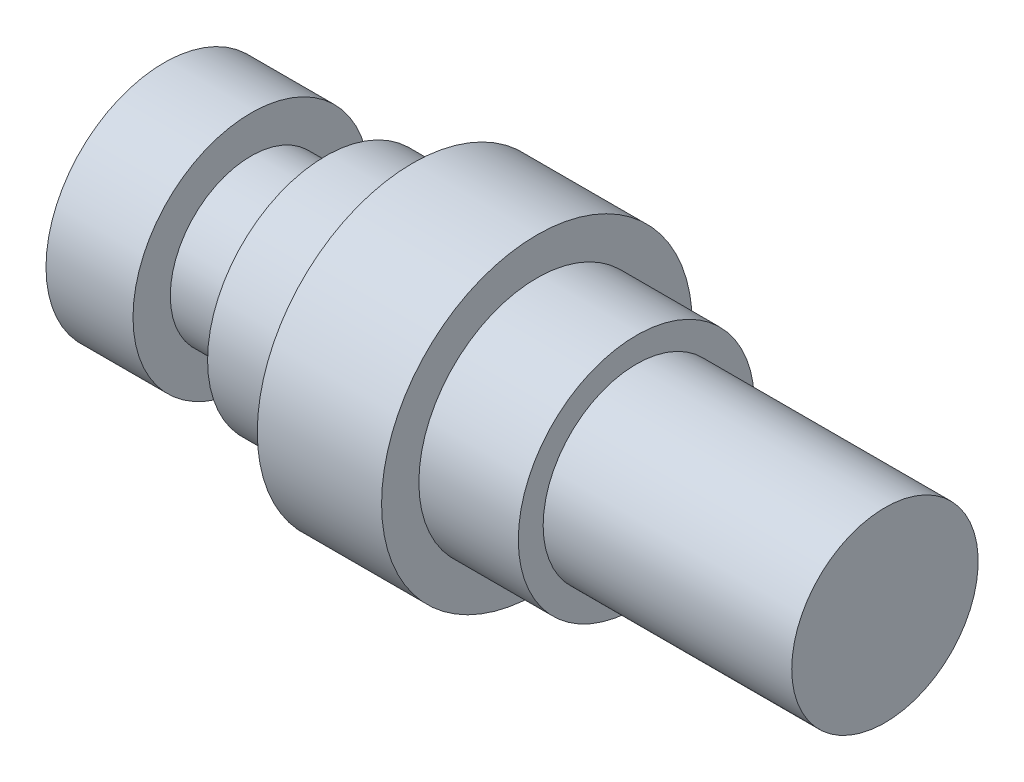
ISO-10303-21;
HEADER;
FILE_DESCRIPTION(('STEP AP214'),'2;1');
FILE_NAME('part.step','',(''),(''),'','','');
FILE_SCHEMA(('AUTOMOTIVE_DESIGN { 1 0 10303 214 1 1 1 1 }'));
ENDSEC;
DATA;
#1=APPLICATION_CONTEXT('core data for automotive mechanical design processes');
#2=APPLICATION_PROTOCOL_DEFINITION('international standard','automotive_design',2000,#1);
#3=PRODUCT_CONTEXT('',#1,'mechanical');
#4=PRODUCT('Part','Part','',(#3));
#5=PRODUCT_RELATED_PRODUCT_CATEGORY('part','',(#4));
#6=PRODUCT_DEFINITION_FORMATION('','',#4);
#7=PRODUCT_DEFINITION_CONTEXT('part definition',#1,'design');
#8=PRODUCT_DEFINITION('design','',#6,#7);
#9=PRODUCT_DEFINITION_SHAPE('','',#8);
#10=(LENGTH_UNIT() NAMED_UNIT(*) SI_UNIT(.MILLI.,.METRE.));
#11=(NAMED_UNIT(*) PLANE_ANGLE_UNIT() SI_UNIT($,.RADIAN.));
#12=(NAMED_UNIT(*) SI_UNIT($,.STERADIAN.) SOLID_ANGLE_UNIT());
#13=UNCERTAINTY_MEASURE_WITH_UNIT(LENGTH_MEASURE(1.E-05),#10,'distance_accuracy_value','');
#14=(GEOMETRIC_REPRESENTATION_CONTEXT(3) GLOBAL_UNCERTAINTY_ASSIGNED_CONTEXT((#13)) GLOBAL_UNIT_ASSIGNED_CONTEXT((#10,
#11,#12)) REPRESENTATION_CONTEXT('',''));
#15=CARTESIAN_POINT('',(0.,0.,0.));
#16=DIRECTION('',(0.,0.,1.));
#17=DIRECTION('',(1.,0.,0.));
#18=AXIS2_PLACEMENT_3D('',#15,#16,#17);
#19=CARTESIAN_POINT('',(-70.6829268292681,0.,0.));
#20=DIRECTION('',(1.,0.,0.));
#21=DIRECTION('',(0.,0.,-1.));
#22=AXIS2_PLACEMENT_3D('',#19,#20,#21);
#23=PLANE('',#22);
#24=CARTESIAN_POINT('',(-70.6829268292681,0.,0.));
#25=DIRECTION('',(-1.,0.,0.));
#26=DIRECTION('',(0.,0.,1.));
#27=AXIS2_PLACEMENT_3D('',#24,#25,#26);
#28=CIRCLE('',#27,9.5);
#29=CARTESIAN_POINT('',(-70.6829268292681,0.,9.5));
#30=VERTEX_POINT('',#29);
#31=EDGE_CURVE('E10',#30,#30,#28,.T.);
#32=ORIENTED_EDGE('',*,*,#31,.T.);
#33=EDGE_LOOP('',(#32));
#34=FACE_BOUND('',#33,.T.);
#35=ADVANCED_FACE('F31',(#34),#23,.F.);
#36=CARTESIAN_POINT('',(-78.0243902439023,0.,0.));
#37=DIRECTION('',(-1.,0.,0.));
#38=DIRECTION('',(0.,0.,1.));
#39=AXIS2_PLACEMENT_3D('',#36,#37,#38);
#40=CYLINDRICAL_SURFACE('',#39,9.5);
#41=ORIENTED_EDGE('',*,*,#31,.F.);
#42=EDGE_LOOP('',(#41));
#43=FACE_BOUND('',#42,.T.);
#44=CARTESIAN_POINT('',(-63.6829268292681,0.,0.));
#45=DIRECTION('',(-1.,0.,0.));
#46=DIRECTION('',(0.,0.,1.));
#47=AXIS2_PLACEMENT_3D('',#44,#45,#46);
#48=CIRCLE('',#47,9.5);
#49=CARTESIAN_POINT('',(-63.6829268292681,0.,9.5));
#50=VERTEX_POINT('',#49);
#51=EDGE_CURVE('E37',#50,#50,#48,.T.);
#52=ORIENTED_EDGE('',*,*,#51,.T.);
#53=EDGE_LOOP('',(#52));
#54=FACE_BOUND('',#53,.T.);
#55=ADVANCED_FACE('F87',(#43,#54),#40,.T.);
#56=CARTESIAN_POINT('',(-63.6829268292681,9.5,0.));
#57=DIRECTION('',(-1.,0.,0.));
#58=DIRECTION('',(0.,0.,1.));
#59=AXIS2_PLACEMENT_3D('',#56,#57,#58);
#60=PLANE('',#59);
#61=ORIENTED_EDGE('',*,*,#51,.F.);
#62=EDGE_LOOP('',(#61));
#63=FACE_BOUND('',#62,.T.);
#64=CARTESIAN_POINT('',(-63.6829268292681,0.,0.));
#65=DIRECTION('',(-1.,0.,0.));
#66=DIRECTION('',(0.,0.,1.));
#67=AXIS2_PLACEMENT_3D('',#64,#65,#66);
#68=CIRCLE('',#67,6.5);
#69=CARTESIAN_POINT('',(-63.6829268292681,0.,6.5));
#70=VERTEX_POINT('',#69);
#71=EDGE_CURVE('E41',#70,#70,#68,.T.);
#72=ORIENTED_EDGE('',*,*,#71,.T.);
#73=EDGE_LOOP('',(#72));
#74=FACE_BOUND('',#73,.T.);
#75=ADVANCED_FACE('F91',(#63,#74),#60,.F.);
#76=CARTESIAN_POINT('',(-78.0243902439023,0.,0.));
#77=DIRECTION('',(-1.,0.,0.));
#78=DIRECTION('',(0.,0.,1.));
#79=AXIS2_PLACEMENT_3D('',#76,#77,#78);
#80=CYLINDRICAL_SURFACE('',#79,6.5);
#81=ORIENTED_EDGE('',*,*,#71,.F.);
#82=EDGE_LOOP('',(#81));
#83=FACE_BOUND('',#82,.T.);
#84=CARTESIAN_POINT('',(-57.6829268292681,0.,0.));
#85=DIRECTION('',(-1.,0.,0.));
#86=DIRECTION('',(0.,0.,1.));
#87=AXIS2_PLACEMENT_3D('',#84,#85,#86);
#88=CIRCLE('',#87,6.5);
#89=CARTESIAN_POINT('',(-57.6829268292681,0.,6.5));
#90=VERTEX_POINT('',#89);
#91=EDGE_CURVE('E45',#90,#90,#88,.T.);
#92=ORIENTED_EDGE('',*,*,#91,.T.);
#93=EDGE_LOOP('',(#92));
#94=FACE_BOUND('',#93,.T.);
#95=ADVANCED_FACE('F96',(#83,#94),#80,.T.);
#96=CARTESIAN_POINT('',(-57.6829268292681,6.5,0.));
#97=DIRECTION('',(1.,0.,0.));
#98=DIRECTION('',(0.,0.,-1.));
#99=AXIS2_PLACEMENT_3D('',#96,#97,#98);
#100=PLANE('',#99);
#101=ORIENTED_EDGE('',*,*,#91,.F.);
#102=EDGE_LOOP('',(#101));
#103=FACE_BOUND('',#102,.T.);
#104=CARTESIAN_POINT('',(-57.6829268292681,0.,0.));
#105=DIRECTION('',(-1.,0.,0.));
#106=DIRECTION('',(0.,0.,1.));
#107=AXIS2_PLACEMENT_3D('',#104,#105,#106);
#108=CIRCLE('',#107,9.5);
#109=CARTESIAN_POINT('',(-57.6829268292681,0.,9.5));
#110=VERTEX_POINT('',#109);
#111=EDGE_CURVE('E50',#110,#110,#108,.T.);
#112=ORIENTED_EDGE('',*,*,#111,.T.);
#113=EDGE_LOOP('',(#112));
#114=FACE_BOUND('',#113,.T.);
#115=ADVANCED_FACE('F102',(#103,#114),#100,.F.);
#116=CARTESIAN_POINT('',(-78.0243902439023,0.,0.));
#117=DIRECTION('',(-1.,0.,0.));
#118=DIRECTION('',(0.,0.,1.));
#119=AXIS2_PLACEMENT_3D('',#116,#117,#118);
#120=CYLINDRICAL_SURFACE('',#119,9.5);
#121=ORIENTED_EDGE('',*,*,#111,.F.);
#122=EDGE_LOOP('',(#121));
#123=FACE_BOUND('',#122,.T.);
#124=CARTESIAN_POINT('',(-50.6829268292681,0.,0.));
#125=DIRECTION('',(-1.,0.,0.));
#126=DIRECTION('',(0.,0.,1.));
#127=AXIS2_PLACEMENT_3D('',#124,#125,#126);
#128=CIRCLE('',#127,9.5);
#129=CARTESIAN_POINT('',(-50.6829268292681,0.,9.5));
#130=VERTEX_POINT('',#129);
#131=EDGE_CURVE('E53',#130,#130,#128,.T.);
#132=ORIENTED_EDGE('',*,*,#131,.T.);
#133=EDGE_LOOP('',(#132));
#134=FACE_BOUND('',#133,.T.);
#135=ADVANCED_FACE('F106',(#123,#134),#120,.T.);
#136=CARTESIAN_POINT('',(-50.6829268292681,9.5,0.));
#137=DIRECTION('',(1.,0.,0.));
#138=DIRECTION('',(0.,0.,-1.));
#139=AXIS2_PLACEMENT_3D('',#136,#137,#138);
#140=PLANE('',#139);
#141=ORIENTED_EDGE('',*,*,#131,.F.);
#142=EDGE_LOOP('',(#141));
#143=FACE_BOUND('',#142,.T.);
#144=CARTESIAN_POINT('',(-50.6829268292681,0.,0.));
#145=DIRECTION('',(-1.,0.,0.));
#146=DIRECTION('',(0.,0.,1.));
#147=AXIS2_PLACEMENT_3D('',#144,#145,#146);
#148=CIRCLE('',#147,12.5);
#149=CARTESIAN_POINT('',(-50.6829268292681,0.,12.5));
#150=VERTEX_POINT('',#149);
#151=EDGE_CURVE('E56',#150,#150,#148,.T.);
#152=ORIENTED_EDGE('',*,*,#151,.T.);
#153=EDGE_LOOP('',(#152));
#154=FACE_BOUND('',#153,.T.);
#155=ADVANCED_FACE('F110',(#143,#154),#140,.F.);
#156=CARTESIAN_POINT('',(-78.0243902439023,0.,0.));
#157=DIRECTION('',(-1.,0.,0.));
#158=DIRECTION('',(0.,0.,1.));
#159=AXIS2_PLACEMENT_3D('',#156,#157,#158);
#160=CYLINDRICAL_SURFACE('',#159,12.5);
#161=ORIENTED_EDGE('',*,*,#151,.F.);
#162=EDGE_LOOP('',(#161));
#163=FACE_BOUND('',#162,.T.);
#164=CARTESIAN_POINT('',(-40.6829268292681,0.,0.));
#165=DIRECTION('',(-1.,0.,0.));
#166=DIRECTION('',(0.,0.,1.));
#167=AXIS2_PLACEMENT_3D('',#164,#165,#166);
#168=CIRCLE('',#167,12.5);
#169=CARTESIAN_POINT('',(-40.6829268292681,0.,12.5));
#170=VERTEX_POINT('',#169);
#171=EDGE_CURVE('E59',#170,#170,#168,.T.);
#172=ORIENTED_EDGE('',*,*,#171,.T.);
#173=EDGE_LOOP('',(#172));
#174=FACE_BOUND('',#173,.T.);
#175=ADVANCED_FACE('F114',(#163,#174),#160,.T.);
#176=CARTESIAN_POINT('',(-40.6829268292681,12.5,0.));
#177=DIRECTION('',(-1.,0.,0.));
#178=DIRECTION('',(0.,0.,1.));
#179=AXIS2_PLACEMENT_3D('',#176,#177,#178);
#180=PLANE('',#179);
#181=ORIENTED_EDGE('',*,*,#171,.F.);
#182=EDGE_LOOP('',(#181));
#183=FACE_BOUND('',#182,.T.);
#184=CARTESIAN_POINT('',(-40.6829268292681,0.,0.));
#185=DIRECTION('',(-1.,0.,0.));
#186=DIRECTION('',(0.,0.,1.));
#187=AXIS2_PLACEMENT_3D('',#184,#185,#186);
#188=CIRCLE('',#187,9.5);
#189=CARTESIAN_POINT('',(-40.6829268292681,0.,9.5));
#190=VERTEX_POINT('',#189);
#191=EDGE_CURVE('E62',#190,#190,#188,.T.);
#192=ORIENTED_EDGE('',*,*,#191,.T.);
#193=EDGE_LOOP('',(#192));
#194=FACE_BOUND('',#193,.T.);
#195=ADVANCED_FACE('F118',(#183,#194),#180,.F.);
#196=CARTESIAN_POINT('',(-78.0243902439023,0.,0.));
#197=DIRECTION('',(-1.,0.,0.));
#198=DIRECTION('',(0.,0.,1.));
#199=AXIS2_PLACEMENT_3D('',#196,#197,#198);
#200=CYLINDRICAL_SURFACE('',#199,9.5);
#201=ORIENTED_EDGE('',*,*,#191,.F.);
#202=EDGE_LOOP('',(#201));
#203=FACE_BOUND('',#202,.T.);
#204=CARTESIAN_POINT('',(-32.6829268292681,0.,0.));
#205=DIRECTION('',(-1.,0.,0.));
#206=DIRECTION('',(0.,0.,1.));
#207=AXIS2_PLACEMENT_3D('',#204,#205,#206);
#208=CIRCLE('',#207,9.5);
#209=CARTESIAN_POINT('',(-32.6829268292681,0.,9.5));
#210=VERTEX_POINT('',#209);
#211=EDGE_CURVE('E65',#210,#210,#208,.T.);
#212=ORIENTED_EDGE('',*,*,#211,.T.);
#213=EDGE_LOOP('',(#212));
#214=FACE_BOUND('',#213,.T.);
#215=ADVANCED_FACE('F122',(#203,#214),#200,.T.);
#216=CARTESIAN_POINT('',(-32.6829268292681,9.5,0.));
#217=DIRECTION('',(-1.,0.,0.));
#218=DIRECTION('',(0.,0.,1.));
#219=AXIS2_PLACEMENT_3D('',#216,#217,#218);
#220=PLANE('',#219);
#221=ORIENTED_EDGE('',*,*,#211,.F.);
#222=EDGE_LOOP('',(#221));
#223=FACE_BOUND('',#222,.T.);
#224=CARTESIAN_POINT('',(-32.6829268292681,0.,0.));
#225=DIRECTION('',(-1.,0.,0.));
#226=DIRECTION('',(0.,0.,1.));
#227=AXIS2_PLACEMENT_3D('',#224,#225,#226);
#228=CIRCLE('',#227,7.5);
#229=CARTESIAN_POINT('',(-32.6829268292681,0.,7.5));
#230=VERTEX_POINT('',#229);
#231=EDGE_CURVE('E68',#230,#230,#228,.T.);
#232=ORIENTED_EDGE('',*,*,#231,.T.);
#233=EDGE_LOOP('',(#232));
#234=FACE_BOUND('',#233,.T.);
#235=ADVANCED_FACE('F83',(#223,#234),#220,.F.);
#236=CARTESIAN_POINT('',(-78.0243902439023,0.,0.));
#237=DIRECTION('',(-1.,0.,0.));
#238=DIRECTION('',(0.,0.,1.));
#239=AXIS2_PLACEMENT_3D('',#236,#237,#238);
#240=CYLINDRICAL_SURFACE('',#239,7.5);
#241=ORIENTED_EDGE('',*,*,#231,.F.);
#242=EDGE_LOOP('',(#241));
#243=FACE_BOUND('',#242,.T.);
#244=CARTESIAN_POINT('',(-12.6829268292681,0.,0.));
#245=DIRECTION('',(-1.,0.,0.));
#246=DIRECTION('',(0.,0.,1.));
#247=AXIS2_PLACEMENT_3D('',#244,#245,#246);
#248=CIRCLE('',#247,7.5);
#249=CARTESIAN_POINT('',(-12.6829268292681,0.,7.5));
#250=VERTEX_POINT('',#249);
#251=EDGE_CURVE('E71',#250,#250,#248,.T.);
#252=ORIENTED_EDGE('',*,*,#251,.T.);
#253=EDGE_LOOP('',(#252));
#254=FACE_BOUND('',#253,.T.);
#255=ADVANCED_FACE('F75',(#243,#254),#240,.T.);
#256=CARTESIAN_POINT('',(-12.6829268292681,7.5,0.));
#257=DIRECTION('',(-1.,0.,0.));
#258=DIRECTION('',(0.,0.,1.));
#259=AXIS2_PLACEMENT_3D('',#256,#257,#258);
#260=PLANE('',#259);
#261=ORIENTED_EDGE('',*,*,#251,.F.);
#262=EDGE_LOOP('',(#261));
#263=FACE_BOUND('',#262,.T.);
#264=ADVANCED_FACE('F77',(#263),#260,.F.);
#265=CLOSED_SHELL('',(#35,#55,#75,#95,#115,#135,#155,#175,#195,#215,#235,#255,#264));
#266=MANIFOLD_SOLID_BREP('B2',#265);
#267=ADVANCED_BREP_SHAPE_REPRESENTATION('',(#18,#266),#14);
#268=SHAPE_DEFINITION_REPRESENTATION(#9,#267);
ENDSEC;
END-ISO-10303-21;
